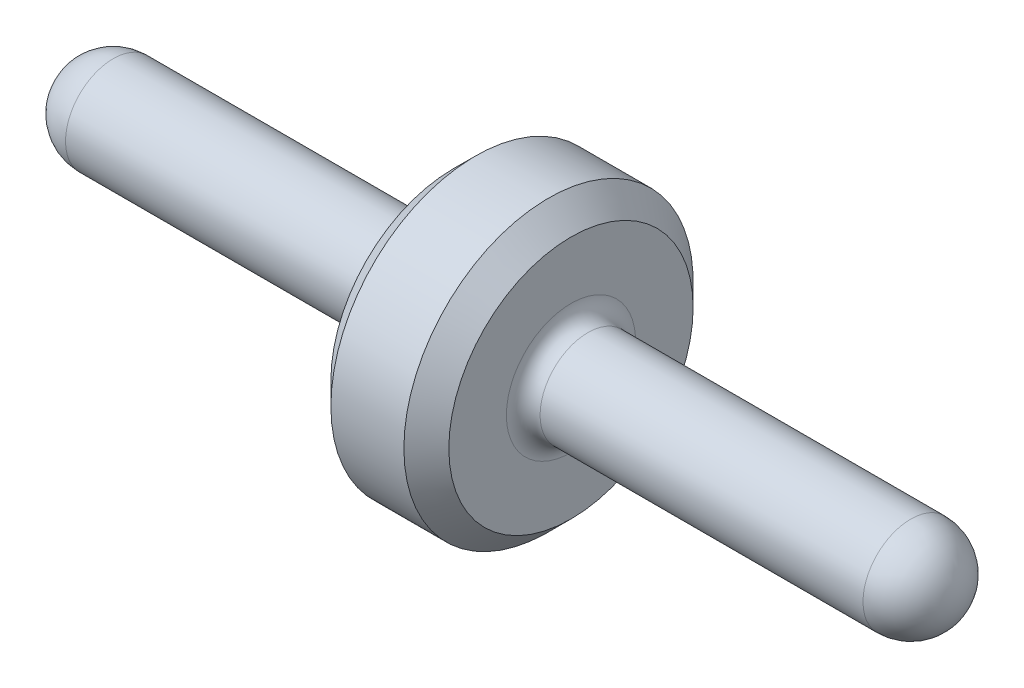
from build123d import *


with BuildPart() as part:
    # Sketch1 → RevolutionAngle1 (revolve)
    with BuildSketch(Plane.XY, mode=Mode.PRIVATE) as revolutionangle1_sk:
        with BuildLine():
            Line((0.2159, 0.2159), (1.6764, 0.2159))
            ThreePointArc((1.6764, 0.2159), (1.730281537, 0.238218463), (1.7526, 0.2921))
            Line((1.7526, 0.2921), (1.7526, 0.55245))
            Line((1.7526, 0.55245), (1.8542, 0.65405))
            Line((1.8542, 0.65405), (2.1844, 0.65405))
            Line((2.1844, 0.65405), (2.286, 0.55245))
            Line((2.286, 0.55245), (2.286, 0.2921))
            ThreePointArc((2.286, 0.2921), (2.308318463, 0.238218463), (2.3622, 0.2159))
            Line((2.3622, 0.2159), (3.8227, 0.2159))
            ThreePointArc((3.8227, 0.2159), (3.975364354, 0.152664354), (4.0386, 0))
            Line((4.0386, 0), (0, 0))
            ThreePointArc((0, 0), (0.063235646, 0.152664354), (0.2159, 0.2159))
        make_face()
    revolve(revolutionangle1_sk.sketch.rotate(Axis((0, 0, 0), (1, 0, 0)), 90), axis=Axis((0, 0, 0), (1, 0, 0)))


solid = part.part
